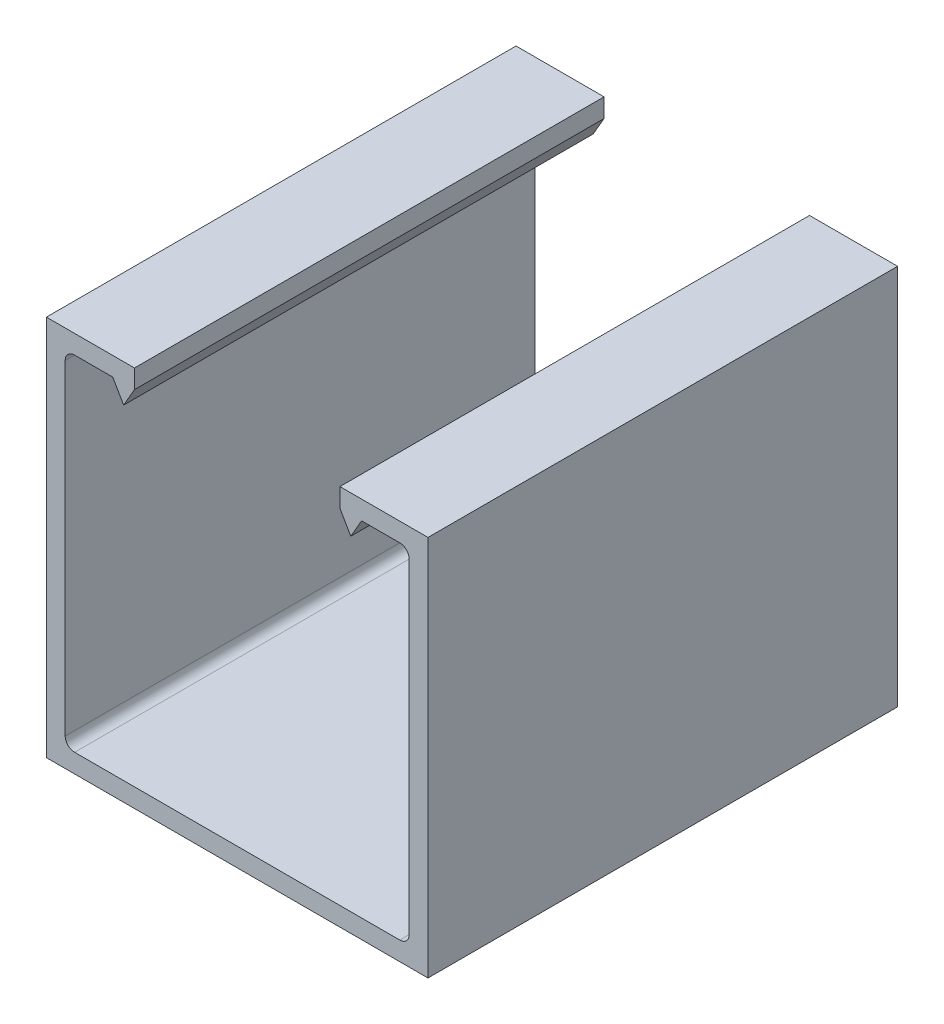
from build123d import *

# Parameters (mm, degrees)
BASE_EXTRUDE_DEPTH = 12.7


with BuildPart() as part:
    # Sketch1 → Base-Extrude (new, symmetric)
    with BuildSketch(Plane.XY):
        with BuildLine():
            Line((-5.55625, 10.31875), (-10.31875, 10.31875))
            Line((-10.31875, 10.31875), (-10.31875, -10.31875))
            Line((-10.31875, -10.31875), (10.31875, -10.31875))
            Line((10.31875, -10.31875), (10.31875, 10.31875))
            Line((10.31875, 10.31875), (5.55625, 10.31875))
            Line((5.55625, 10.31875), (5.55625, 9.30275))
            Line((5.55625, 9.30275), (6.142837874, 8.28675))
            Line((6.142837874, 8.28675), (6.729425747, 9.30275))
            Line((6.729425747, 9.30275), (8.79475, 9.30275))
            ThreePointArc((8.79475, 9.30275), (9.153960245, 9.153960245), (9.30275, 8.79475))
            Line((9.30275, 8.79475), (9.30275, -8.79475))
            ThreePointArc((9.30275, -8.79475), (9.153960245, -9.153960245), (8.79475, -9.30275))
            Line((8.79475, -9.30275), (-8.79475, -9.30275))
            ThreePointArc((-8.79475, -9.30275), (-9.153960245, -9.153960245), (-9.30275, -8.79475))
            Line((-9.30275, -8.79475), (-9.30275, 8.79475))
            ThreePointArc((-9.30275, 8.79475), (-9.153960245, 9.153960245), (-8.79475, 9.30275))
            Line((-8.79475, 9.30275), (-6.729425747, 9.30275))
            Line((-6.729425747, 9.30275), (-6.142837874, 8.28675))
            Line((-6.142837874, 8.28675), (-5.55625, 9.30275))
            Line((-5.55625, 9.30275), (-5.55625, 10.31875))
        make_face()
    extrude(amount=BASE_EXTRUDE_DEPTH, both=True)


solid = part.part
